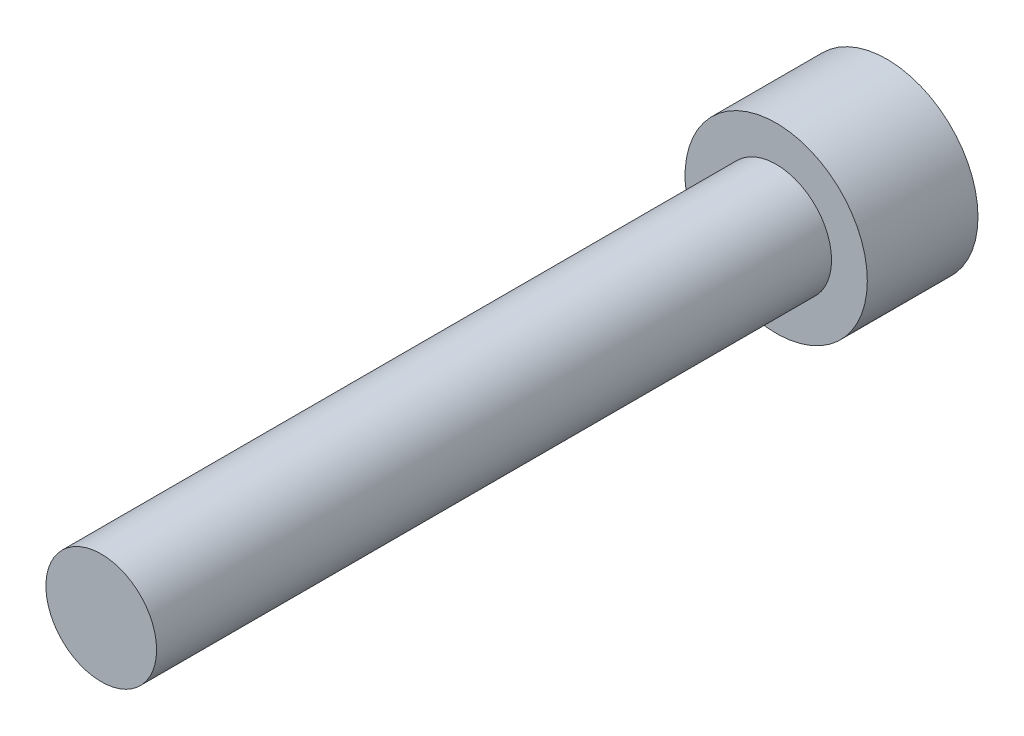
from build123d import *

# Parameters (mm, degrees)
HEX_2_DEPTH = 2.794


with BuildPart() as part:
    # Sketch6 → Revolve1 (revolve)
    with BuildSketch(Plane(origin=(0, 0, 0), x_dir=(0, 0, -1), z_dir=(1, 0, 0)), mode=Mode.PRIVATE) as revolve1_sk:
        Polygon((-25.4, 0), (-25.4, -2.0828), (0, -2.0828), (0, -3.429), (4.1656, -3.429), (4.1656, 0), align=None)
    revolve(revolve1_sk.sketch.rotate(Axis((0, 0, 25.4), (0, 0, -1)), 270), axis=Axis((0, 0, 25.4), (0, 0, -1)))

    # Sketch7 → HEX 2 (cut)
    with BuildSketch(Plane(origin=(0, 0, -4.1656), x_dir=(-1, 0, 0), z_dir=(0, 0, -1))):
        Polygon((-1.778, 1.026528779), (-1.778, -1.026528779), (0, -2.053057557), (1.778, -1.026528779), (1.778, 1.026528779), (0, 2.053057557), align=None)
    extrude(amount=-HEX_2_DEPTH, mode=Mode.SUBTRACT)


solid = part.part
